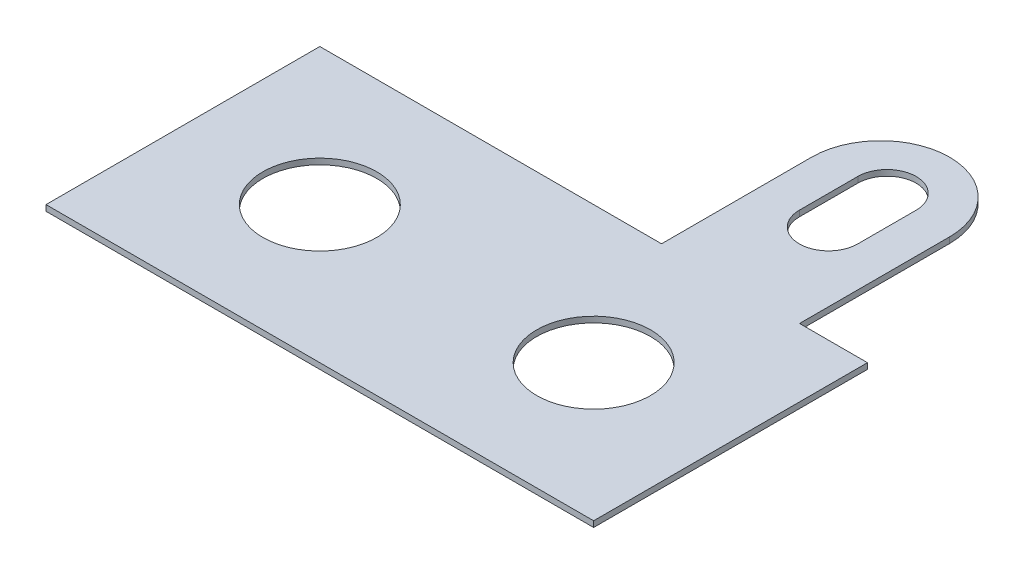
ISO-10303-21;
HEADER;
FILE_DESCRIPTION(('STEP AP214'),'2;1');
FILE_NAME('part.step','',(''),(''),'','','');
FILE_SCHEMA(('AUTOMOTIVE_DESIGN { 1 0 10303 214 1 1 1 1 }'));
ENDSEC;
DATA;
#1=APPLICATION_CONTEXT('core data for automotive mechanical design processes');
#2=APPLICATION_PROTOCOL_DEFINITION('international standard','automotive_design',2000,#1);
#3=PRODUCT_CONTEXT('',#1,'mechanical');
#4=PRODUCT('Part','Part','',(#3));
#5=PRODUCT_RELATED_PRODUCT_CATEGORY('part','',(#4));
#6=PRODUCT_DEFINITION_FORMATION('','',#4);
#7=PRODUCT_DEFINITION_CONTEXT('part definition',#1,'design');
#8=PRODUCT_DEFINITION('design','',#6,#7);
#9=PRODUCT_DEFINITION_SHAPE('','',#8);
#10=(LENGTH_UNIT() NAMED_UNIT(*) SI_UNIT(.MILLI.,.METRE.));
#11=(NAMED_UNIT(*) PLANE_ANGLE_UNIT() SI_UNIT($,.RADIAN.));
#12=(NAMED_UNIT(*) SI_UNIT($,.STERADIAN.) SOLID_ANGLE_UNIT());
#13=UNCERTAINTY_MEASURE_WITH_UNIT(LENGTH_MEASURE(1.E-05),#10,'distance_accuracy_value','');
#14=(GEOMETRIC_REPRESENTATION_CONTEXT(3) GLOBAL_UNCERTAINTY_ASSIGNED_CONTEXT((#13)) GLOBAL_UNIT_ASSIGNED_CONTEXT((#10,
#11,#12)) REPRESENTATION_CONTEXT('',''));
#15=CARTESIAN_POINT('',(0.,0.,0.));
#16=DIRECTION('',(0.,0.,1.));
#17=DIRECTION('',(1.,0.,0.));
#18=AXIS2_PLACEMENT_3D('',#15,#16,#17);
#19=CARTESIAN_POINT('',(-9.525,0.2032,-4.7625));
#20=DIRECTION('',(0.,0.,1.));
#21=DIRECTION('',(1.,0.,0.));
#22=AXIS2_PLACEMENT_3D('',#19,#20,#21);
#23=PLANE('',#22);
#24=DIRECTION('',(0.,-1.,0.));
#25=VECTOR('',#24,1.);
#26=CARTESIAN_POINT('',(7.1628,0.2032,-4.7625));
#27=LINE('',#26,#25);
#28=CARTESIAN_POINT('',(7.1628,0.2032,-4.7625));
#29=VERTEX_POINT('',#28);
#30=CARTESIAN_POINT('',(7.1628,0.,-4.7625));
#31=VERTEX_POINT('',#30);
#32=EDGE_CURVE('E195',#29,#31,#27,.T.);
#33=ORIENTED_EDGE('',*,*,#32,.F.);
#34=DIRECTION('',(-1.,0.,0.));
#35=VECTOR('',#34,1.);
#36=CARTESIAN_POINT('',(-9.525,0.2032,-4.7625));
#37=LINE('',#36,#35);
#38=CARTESIAN_POINT('',(9.525,0.2032,-4.7625));
#39=VERTEX_POINT('',#38);
#40=EDGE_CURVE('E91',#39,#29,#37,.T.);
#41=ORIENTED_EDGE('',*,*,#40,.F.);
#42=DIRECTION('',(0.,-1.,0.));
#43=VECTOR('',#42,1.);
#44=CARTESIAN_POINT('',(9.525,0.2032,-4.7625));
#45=LINE('',#44,#43);
#46=CARTESIAN_POINT('',(9.525,0.,-4.7625));
#47=VERTEX_POINT('',#46);
#48=EDGE_CURVE('E11',#39,#47,#45,.T.);
#49=ORIENTED_EDGE('',*,*,#48,.T.);
#50=DIRECTION('',(-1.,0.,0.));
#51=VECTOR('',#50,1.);
#52=CARTESIAN_POINT('',(-9.525,0.,-4.7625));
#53=LINE('',#52,#51);
#54=EDGE_CURVE('E245',#47,#31,#53,.T.);
#55=ORIENTED_EDGE('',*,*,#54,.T.);
#56=EDGE_LOOP('',(#33,#41,#49,#55));
#57=FACE_BOUND('',#56,.T.);
#58=ADVANCED_FACE('F37',(#57),#23,.F.);
#59=CARTESIAN_POINT('',(0.,0.2032,0.));
#60=DIRECTION('',(0.,-1.,0.));
#61=DIRECTION('',(0.,0.,-1.));
#62=AXIS2_PLACEMENT_3D('',#59,#60,#61);
#63=PLANE('',#62);
#64=CARTESIAN_POINT('',(-4.7625,0.2032,0.));
#65=DIRECTION('',(0.,1.,0.));
#66=DIRECTION('',(0.,0.,1.));
#67=AXIS2_PLACEMENT_3D('',#64,#65,#66);
#68=CIRCLE('',#67,1.9812);
#69=CARTESIAN_POINT('',(-4.7625,0.2032,1.9812));
#70=VERTEX_POINT('',#69);
#71=EDGE_CURVE('E225',#70,#70,#68,.T.);
#72=ORIENTED_EDGE('',*,*,#71,.F.);
#73=EDGE_LOOP('',(#72));
#74=FACE_BOUND('',#73,.T.);
#75=DIRECTION('',(0.,0.,-1.));
#76=VECTOR('',#75,1.);
#77=CARTESIAN_POINT('',(9.525,0.2032,4.7625));
#78=LINE('',#77,#76);
#79=CARTESIAN_POINT('',(9.525,0.2032,4.7625));
#80=VERTEX_POINT('',#79);
#81=EDGE_CURVE('E231',#80,#39,#78,.T.);
#82=ORIENTED_EDGE('',*,*,#81,.T.);
#83=ORIENTED_EDGE('',*,*,#40,.T.);
#84=DIRECTION('',(0.,0.,-1.));
#85=VECTOR('',#84,1.);
#86=CARTESIAN_POINT('',(7.1628,0.2032,0.));
#87=LINE('',#86,#85);
#88=CARTESIAN_POINT('',(7.1628,0.2032,-9.9822));
#89=VERTEX_POINT('',#88);
#90=EDGE_CURVE('E159',#29,#89,#87,.T.);
#91=ORIENTED_EDGE('',*,*,#90,.T.);
#92=CARTESIAN_POINT('',(4.7625,0.2032,-9.9822));
#93=DIRECTION('',(0.,-1.,0.));
#94=DIRECTION('',(0.,0.,-1.));
#95=AXIS2_PLACEMENT_3D('',#92,#93,#94);
#96=CIRCLE('',#95,2.4003);
#97=CARTESIAN_POINT('',(2.3622,0.2032,-9.9822));
#98=VERTEX_POINT('',#97);
#99=EDGE_CURVE('E173',#98,#89,#96,.T.);
#100=ORIENTED_EDGE('',*,*,#99,.F.);
#101=DIRECTION('',(0.,0.,-1.));
#102=VECTOR('',#101,1.);
#103=CARTESIAN_POINT('',(2.3622,0.2032,0.));
#104=LINE('',#103,#102);
#105=CARTESIAN_POINT('',(2.3622,0.2032,-4.7625));
#106=VERTEX_POINT('',#105);
#107=EDGE_CURVE('E172',#106,#98,#104,.T.);
#108=ORIENTED_EDGE('',*,*,#107,.F.);
#109=CARTESIAN_POINT('',(-9.525,0.2032,-4.7625));
#110=VERTEX_POINT('',#109);
#111=EDGE_CURVE('E233',#106,#110,#37,.T.);
#112=ORIENTED_EDGE('',*,*,#111,.T.);
#113=DIRECTION('',(0.,0.,1.));
#114=VECTOR('',#113,1.);
#115=CARTESIAN_POINT('',(-9.525,0.2032,4.7625));
#116=LINE('',#115,#114);
#117=CARTESIAN_POINT('',(-9.525,0.2032,4.7625));
#118=VERTEX_POINT('',#117);
#119=EDGE_CURVE('E236',#110,#118,#116,.T.);
#120=ORIENTED_EDGE('',*,*,#119,.T.);
#121=DIRECTION('',(1.,0.,0.));
#122=VECTOR('',#121,1.);
#123=CARTESIAN_POINT('',(-9.525,0.2032,4.7625));
#124=LINE('',#123,#122);
#125=EDGE_CURVE('E63',#118,#80,#124,.T.);
#126=ORIENTED_EDGE('',*,*,#125,.T.);
#127=EDGE_LOOP('',(#82,#83,#91,#100,#108,#112,#120,#126));
#128=FACE_BOUND('',#127,.T.);
#129=CARTESIAN_POINT('',(4.7625,0.2032,0.));
#130=DIRECTION('',(0.,1.,0.));
#131=DIRECTION('',(0.,0.,-1.));
#132=AXIS2_PLACEMENT_3D('',#129,#130,#131);
#133=CIRCLE('',#132,1.9812);
#134=CARTESIAN_POINT('',(4.7625,0.2032,-1.9812));
#135=VERTEX_POINT('',#134);
#136=EDGE_CURVE('E219',#135,#135,#133,.T.);
#137=ORIENTED_EDGE('',*,*,#136,.F.);
#138=EDGE_LOOP('',(#137));
#139=FACE_BOUND('',#138,.T.);
#140=CARTESIAN_POINT('',(4.7625,0.2032,-8.17171291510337));
#141=DIRECTION('',(0.,-1.,0.));
#142=DIRECTION('',(0.,0.,-1.));
#143=AXIS2_PLACEMENT_3D('',#140,#141,#142);
#144=CIRCLE('',#143,1.016);
#145=CARTESIAN_POINT('',(5.7785,0.2032,-8.17171291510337));
#146=VERTEX_POINT('',#145);
#147=CARTESIAN_POINT('',(3.7465,0.2032,-8.17171291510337));
#148=VERTEX_POINT('',#147);
#149=EDGE_CURVE('E142',#146,#148,#144,.T.);
#150=ORIENTED_EDGE('',*,*,#149,.T.);
#151=DIRECTION('',(0.,0.,1.));
#152=VECTOR('',#151,1.);
#153=CARTESIAN_POINT('',(3.7465,0.2032,0.));
#154=LINE('',#153,#152);
#155=CARTESIAN_POINT('',(3.7465,0.2032,-10.2037129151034));
#156=VERTEX_POINT('',#155);
#157=EDGE_CURVE('E170',#156,#148,#154,.T.);
#158=ORIENTED_EDGE('',*,*,#157,.F.);
#159=CARTESIAN_POINT('',(4.7625,0.2032,-10.2037129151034));
#160=DIRECTION('',(0.,-1.,0.));
#161=DIRECTION('',(0.,0.,-1.));
#162=AXIS2_PLACEMENT_3D('',#159,#160,#161);
#163=CIRCLE('',#162,1.016);
#164=CARTESIAN_POINT('',(5.7785,0.2032,-10.2037129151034));
#165=VERTEX_POINT('',#164);
#166=EDGE_CURVE('E145',#156,#165,#163,.T.);
#167=ORIENTED_EDGE('',*,*,#166,.T.);
#168=DIRECTION('',(0.,0.,1.));
#169=VECTOR('',#168,1.);
#170=CARTESIAN_POINT('',(5.7785,0.2032,0.));
#171=LINE('',#170,#169);
#172=EDGE_CURVE('E137',#165,#146,#171,.T.);
#173=ORIENTED_EDGE('',*,*,#172,.T.);
#174=EDGE_LOOP('',(#150,#158,#167,#173));
#175=FACE_BOUND('',#174,.T.);
#176=ADVANCED_FACE('F139',(#74,#128,#139,#175),#63,.F.);
#177=CARTESIAN_POINT('',(0.,0.,0.));
#178=DIRECTION('',(0.,-1.,0.));
#179=DIRECTION('',(0.,0.,-1.));
#180=AXIS2_PLACEMENT_3D('',#177,#178,#179);
#181=PLANE('',#180);
#182=CARTESIAN_POINT('',(-4.7625,0.,0.));
#183=DIRECTION('',(0.,1.,0.));
#184=DIRECTION('',(0.,0.,1.));
#185=AXIS2_PLACEMENT_3D('',#182,#183,#184);
#186=CIRCLE('',#185,1.9812);
#187=CARTESIAN_POINT('',(-4.7625,0.,1.9812));
#188=VERTEX_POINT('',#187);
#189=EDGE_CURVE('E222',#188,#188,#186,.T.);
#190=ORIENTED_EDGE('',*,*,#189,.T.);
#191=EDGE_LOOP('',(#190));
#192=FACE_BOUND('',#191,.T.);
#193=DIRECTION('',(0.,0.,-1.));
#194=VECTOR('',#193,1.);
#195=CARTESIAN_POINT('',(9.525,0.,4.7625));
#196=LINE('',#195,#194);
#197=CARTESIAN_POINT('',(9.525,0.,4.7625));
#198=VERTEX_POINT('',#197);
#199=EDGE_CURVE('E228',#198,#47,#196,.T.);
#200=ORIENTED_EDGE('',*,*,#199,.F.);
#201=DIRECTION('',(1.,0.,0.));
#202=VECTOR('',#201,1.);
#203=CARTESIAN_POINT('',(-9.525,0.,4.7625));
#204=LINE('',#203,#202);
#205=CARTESIAN_POINT('',(-9.525,0.,4.7625));
#206=VERTEX_POINT('',#205);
#207=EDGE_CURVE('E84',#206,#198,#204,.T.);
#208=ORIENTED_EDGE('',*,*,#207,.F.);
#209=DIRECTION('',(0.,0.,1.));
#210=VECTOR('',#209,1.);
#211=CARTESIAN_POINT('',(-9.525,0.,4.7625));
#212=LINE('',#211,#210);
#213=CARTESIAN_POINT('',(-9.525,0.,-4.7625));
#214=VERTEX_POINT('',#213);
#215=EDGE_CURVE('E249',#214,#206,#212,.T.);
#216=ORIENTED_EDGE('',*,*,#215,.F.);
#217=CARTESIAN_POINT('',(2.36219999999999,0.,-4.7625));
#218=VERTEX_POINT('',#217);
#219=EDGE_CURVE('E242',#218,#214,#53,.T.);
#220=ORIENTED_EDGE('',*,*,#219,.F.);
#221=DIRECTION('',(0.,0.,-1.));
#222=VECTOR('',#221,1.);
#223=CARTESIAN_POINT('',(2.3622,0.,0.));
#224=LINE('',#223,#222);
#225=CARTESIAN_POINT('',(2.3622,0.,-9.9822));
#226=VERTEX_POINT('',#225);
#227=EDGE_CURVE('E54',#218,#226,#224,.T.);
#228=ORIENTED_EDGE('',*,*,#227,.T.);
#229=CARTESIAN_POINT('',(4.7625,0.,-9.9822));
#230=DIRECTION('',(0.,-1.,0.));
#231=DIRECTION('',(0.,0.,-1.));
#232=AXIS2_PLACEMENT_3D('',#229,#230,#231);
#233=CIRCLE('',#232,2.4003);
#234=CARTESIAN_POINT('',(7.1628,0.,-9.9822));
#235=VERTEX_POINT('',#234);
#236=EDGE_CURVE('E167',#226,#235,#233,.T.);
#237=ORIENTED_EDGE('',*,*,#236,.T.);
#238=DIRECTION('',(0.,0.,-1.));
#239=VECTOR('',#238,1.);
#240=CARTESIAN_POINT('',(7.1628,0.,0.));
#241=LINE('',#240,#239);
#242=EDGE_CURVE('E164',#31,#235,#241,.T.);
#243=ORIENTED_EDGE('',*,*,#242,.F.);
#244=ORIENTED_EDGE('',*,*,#54,.F.);
#245=EDGE_LOOP('',(#200,#208,#216,#220,#228,#237,#243,#244));
#246=FACE_BOUND('',#245,.T.);
#247=CARTESIAN_POINT('',(4.7625,0.,0.));
#248=DIRECTION('',(0.,1.,0.));
#249=DIRECTION('',(0.,0.,-1.));
#250=AXIS2_PLACEMENT_3D('',#247,#248,#249);
#251=CIRCLE('',#250,1.9812);
#252=CARTESIAN_POINT('',(4.7625,0.,-1.9812));
#253=VERTEX_POINT('',#252);
#254=EDGE_CURVE('E194',#253,#253,#251,.T.);
#255=ORIENTED_EDGE('',*,*,#254,.T.);
#256=EDGE_LOOP('',(#255));
#257=FACE_BOUND('',#256,.T.);
#258=CARTESIAN_POINT('',(4.7625,0.,-8.17171291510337));
#259=DIRECTION('',(0.,-1.,0.));
#260=DIRECTION('',(0.,0.,-1.));
#261=AXIS2_PLACEMENT_3D('',#258,#259,#260);
#262=CIRCLE('',#261,1.016);
#263=CARTESIAN_POINT('',(5.7785,0.,-8.17171291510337));
#264=VERTEX_POINT('',#263);
#265=CARTESIAN_POINT('',(3.7465,0.,-8.17171291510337));
#266=VERTEX_POINT('',#265);
#267=EDGE_CURVE('E176',#264,#266,#262,.T.);
#268=ORIENTED_EDGE('',*,*,#267,.F.);
#269=DIRECTION('',(0.,0.,1.));
#270=VECTOR('',#269,1.);
#271=CARTESIAN_POINT('',(5.7785,0.,0.));
#272=LINE('',#271,#270);
#273=CARTESIAN_POINT('',(5.7785,0.,-10.2037129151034));
#274=VERTEX_POINT('',#273);
#275=EDGE_CURVE('E154',#274,#264,#272,.T.);
#276=ORIENTED_EDGE('',*,*,#275,.F.);
#277=CARTESIAN_POINT('',(4.7625,0.,-10.2037129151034));
#278=DIRECTION('',(0.,-1.,0.));
#279=DIRECTION('',(0.,0.,-1.));
#280=AXIS2_PLACEMENT_3D('',#277,#278,#279);
#281=CIRCLE('',#280,1.016);
#282=CARTESIAN_POINT('',(3.7465,0.,-10.2037129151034));
#283=VERTEX_POINT('',#282);
#284=EDGE_CURVE('E179',#283,#274,#281,.T.);
#285=ORIENTED_EDGE('',*,*,#284,.F.);
#286=DIRECTION('',(0.,0.,1.));
#287=VECTOR('',#286,1.);
#288=CARTESIAN_POINT('',(3.7465,0.,0.));
#289=LINE('',#288,#287);
#290=EDGE_CURVE('E181',#283,#266,#289,.T.);
#291=ORIENTED_EDGE('',*,*,#290,.T.);
#292=EDGE_LOOP('',(#268,#276,#285,#291));
#293=FACE_BOUND('',#292,.T.);
#294=ADVANCED_FACE('F269',(#192,#246,#257,#293),#181,.T.);
#295=CARTESIAN_POINT('',(9.525,0.2032,4.7625));
#296=DIRECTION('',(-1.,0.,0.));
#297=DIRECTION('',(0.,0.,1.));
#298=AXIS2_PLACEMENT_3D('',#295,#296,#297);
#299=PLANE('',#298);
#300=ORIENTED_EDGE('',*,*,#199,.T.);
#301=ORIENTED_EDGE('',*,*,#48,.F.);
#302=ORIENTED_EDGE('',*,*,#81,.F.);
#303=DIRECTION('',(0.,-1.,0.));
#304=VECTOR('',#303,1.);
#305=CARTESIAN_POINT('',(9.525,0.2032,4.7625));
#306=LINE('',#305,#304);
#307=EDGE_CURVE('E253',#80,#198,#306,.T.);
#308=ORIENTED_EDGE('',*,*,#307,.T.);
#309=EDGE_LOOP('',(#300,#301,#302,#308));
#310=FACE_BOUND('',#309,.T.);
#311=ADVANCED_FACE('F39',(#310),#299,.F.);
#312=ORIENTED_EDGE('',*,*,#111,.F.);
#313=DIRECTION('',(0.,-1.,0.));
#314=VECTOR('',#313,1.);
#315=CARTESIAN_POINT('',(2.3622,0.2032,-4.7625));
#316=LINE('',#315,#314);
#317=EDGE_CURVE('E191',#106,#218,#316,.T.);
#318=ORIENTED_EDGE('',*,*,#317,.T.);
#319=ORIENTED_EDGE('',*,*,#219,.T.);
#320=DIRECTION('',(0.,-1.,0.));
#321=VECTOR('',#320,1.);
#322=CARTESIAN_POINT('',(-9.525,0.2032,-4.7625));
#323=LINE('',#322,#321);
#324=EDGE_CURVE('E46',#110,#214,#323,.T.);
#325=ORIENTED_EDGE('',*,*,#324,.F.);
#326=EDGE_LOOP('',(#312,#318,#319,#325));
#327=FACE_BOUND('',#326,.T.);
#328=ADVANCED_FACE('F279',(#327),#23,.F.);
#329=CARTESIAN_POINT('',(-9.525,0.2032,4.7625));
#330=DIRECTION('',(1.,0.,0.));
#331=DIRECTION('',(0.,0.,-1.));
#332=AXIS2_PLACEMENT_3D('',#329,#330,#331);
#333=PLANE('',#332);
#334=ORIENTED_EDGE('',*,*,#215,.T.);
#335=DIRECTION('',(0.,-1.,0.));
#336=VECTOR('',#335,1.);
#337=CARTESIAN_POINT('',(-9.525,0.2032,4.7625));
#338=LINE('',#337,#336);
#339=EDGE_CURVE('E255',#118,#206,#338,.T.);
#340=ORIENTED_EDGE('',*,*,#339,.F.);
#341=ORIENTED_EDGE('',*,*,#119,.F.);
#342=ORIENTED_EDGE('',*,*,#324,.T.);
#343=EDGE_LOOP('',(#334,#340,#341,#342));
#344=FACE_BOUND('',#343,.T.);
#345=ADVANCED_FACE('F262',(#344),#333,.F.);
#346=CARTESIAN_POINT('',(-9.525,0.2032,4.7625));
#347=DIRECTION('',(0.,0.,-1.));
#348=DIRECTION('',(-1.,0.,0.));
#349=AXIS2_PLACEMENT_3D('',#346,#347,#348);
#350=PLANE('',#349);
#351=ORIENTED_EDGE('',*,*,#207,.T.);
#352=ORIENTED_EDGE('',*,*,#307,.F.);
#353=ORIENTED_EDGE('',*,*,#125,.F.);
#354=ORIENTED_EDGE('',*,*,#339,.T.);
#355=EDGE_LOOP('',(#351,#352,#353,#354));
#356=FACE_BOUND('',#355,.T.);
#357=ADVANCED_FACE('F275',(#356),#350,.F.);
#358=CARTESIAN_POINT('',(-4.7625,0.2032,0.));
#359=DIRECTION('',(0.,-1.,0.));
#360=DIRECTION('',(0.,0.,-1.));
#361=AXIS2_PLACEMENT_3D('',#358,#359,#360);
#362=CYLINDRICAL_SURFACE('',#361,1.9812);
#363=ORIENTED_EDGE('',*,*,#71,.T.);
#364=EDGE_LOOP('',(#363));
#365=FACE_BOUND('',#364,.T.);
#366=ORIENTED_EDGE('',*,*,#189,.F.);
#367=EDGE_LOOP('',(#366));
#368=FACE_BOUND('',#367,.T.);
#369=ADVANCED_FACE('F305',(#365,#368),#362,.F.);
#370=CARTESIAN_POINT('',(4.7625,0.2032,0.));
#371=DIRECTION('',(0.,-1.,0.));
#372=DIRECTION('',(0.,0.,-1.));
#373=AXIS2_PLACEMENT_3D('',#370,#371,#372);
#374=CYLINDRICAL_SURFACE('',#373,1.9812);
#375=ORIENTED_EDGE('',*,*,#136,.T.);
#376=EDGE_LOOP('',(#375));
#377=FACE_BOUND('',#376,.T.);
#378=ORIENTED_EDGE('',*,*,#254,.F.);
#379=EDGE_LOOP('',(#378));
#380=FACE_BOUND('',#379,.T.);
#381=ADVANCED_FACE('F309',(#377,#380),#374,.F.);
#382=CARTESIAN_POINT('',(2.3622,0.2032,0.));
#383=DIRECTION('',(-1.,0.,0.));
#384=DIRECTION('',(0.,0.,1.));
#385=AXIS2_PLACEMENT_3D('',#382,#383,#384);
#386=PLANE('',#385);
#387=ORIENTED_EDGE('',*,*,#227,.F.);
#388=ORIENTED_EDGE('',*,*,#317,.F.);
#389=ORIENTED_EDGE('',*,*,#107,.T.);
#390=DIRECTION('',(0.,-1.,0.));
#391=VECTOR('',#390,1.);
#392=CARTESIAN_POINT('',(2.3622,0.2032,-9.9822));
#393=LINE('',#392,#391);
#394=EDGE_CURVE('E209',#98,#226,#393,.T.);
#395=ORIENTED_EDGE('',*,*,#394,.T.);
#396=EDGE_LOOP('',(#387,#388,#389,#395));
#397=FACE_BOUND('',#396,.T.);
#398=ADVANCED_FACE('F280',(#397),#386,.T.);
#399=CARTESIAN_POINT('',(7.1628,0.2032,0.));
#400=DIRECTION('',(-1.,0.,0.));
#401=DIRECTION('',(0.,0.,1.));
#402=AXIS2_PLACEMENT_3D('',#399,#400,#401);
#403=PLANE('',#402);
#404=ORIENTED_EDGE('',*,*,#242,.T.);
#405=DIRECTION('',(0.,-1.,0.));
#406=VECTOR('',#405,1.);
#407=CARTESIAN_POINT('',(7.1628,0.2032,-9.9822));
#408=LINE('',#407,#406);
#409=EDGE_CURVE('E206',#89,#235,#408,.T.);
#410=ORIENTED_EDGE('',*,*,#409,.F.);
#411=ORIENTED_EDGE('',*,*,#90,.F.);
#412=ORIENTED_EDGE('',*,*,#32,.T.);
#413=EDGE_LOOP('',(#404,#410,#411,#412));
#414=FACE_BOUND('',#413,.T.);
#415=ADVANCED_FACE('F282',(#414),#403,.F.);
#416=CARTESIAN_POINT('',(4.7625,0.2032,-8.17171291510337));
#417=DIRECTION('',(0.,-1.,0.));
#418=DIRECTION('',(0.,0.,-1.));
#419=AXIS2_PLACEMENT_3D('',#416,#417,#418);
#420=CYLINDRICAL_SURFACE('',#419,1.016);
#421=ORIENTED_EDGE('',*,*,#267,.T.);
#422=DIRECTION('',(0.,-1.,0.));
#423=VECTOR('',#422,1.);
#424=CARTESIAN_POINT('',(3.7465,0.2032,-8.17171291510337));
#425=LINE('',#424,#423);
#426=EDGE_CURVE('E162',#148,#266,#425,.T.);
#427=ORIENTED_EDGE('',*,*,#426,.F.);
#428=ORIENTED_EDGE('',*,*,#149,.F.);
#429=DIRECTION('',(0.,-1.,0.));
#430=VECTOR('',#429,1.);
#431=CARTESIAN_POINT('',(5.7785,0.2032,-8.17171291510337));
#432=LINE('',#431,#430);
#433=EDGE_CURVE('E151',#146,#264,#432,.T.);
#434=ORIENTED_EDGE('',*,*,#433,.T.);
#435=EDGE_LOOP('',(#421,#427,#428,#434));
#436=FACE_BOUND('',#435,.T.);
#437=ADVANCED_FACE('F161',(#436),#420,.F.);
#438=CARTESIAN_POINT('',(3.7465,0.2032,0.));
#439=DIRECTION('',(1.,0.,0.));
#440=DIRECTION('',(0.,0.,-1.));
#441=AXIS2_PLACEMENT_3D('',#438,#439,#440);
#442=PLANE('',#441);
#443=ORIENTED_EDGE('',*,*,#290,.F.);
#444=DIRECTION('',(0.,-1.,0.));
#445=VECTOR('',#444,1.);
#446=CARTESIAN_POINT('',(3.7465,0.2032,-10.2037129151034));
#447=LINE('',#446,#445);
#448=EDGE_CURVE('E216',#156,#283,#447,.T.);
#449=ORIENTED_EDGE('',*,*,#448,.F.);
#450=ORIENTED_EDGE('',*,*,#157,.T.);
#451=ORIENTED_EDGE('',*,*,#426,.T.);
#452=EDGE_LOOP('',(#443,#449,#450,#451));
#453=FACE_BOUND('',#452,.T.);
#454=ADVANCED_FACE('F320',(#453),#442,.T.);
#455=CARTESIAN_POINT('',(4.7625,0.2032,-10.2037129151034));
#456=DIRECTION('',(0.,-1.,0.));
#457=DIRECTION('',(0.,0.,-1.));
#458=AXIS2_PLACEMENT_3D('',#455,#456,#457);
#459=CYLINDRICAL_SURFACE('',#458,1.016);
#460=ORIENTED_EDGE('',*,*,#284,.T.);
#461=DIRECTION('',(0.,-1.,0.));
#462=VECTOR('',#461,1.);
#463=CARTESIAN_POINT('',(5.7785,0.2032,-10.2037129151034));
#464=LINE('',#463,#462);
#465=EDGE_CURVE('E158',#165,#274,#464,.T.);
#466=ORIENTED_EDGE('',*,*,#465,.F.);
#467=ORIENTED_EDGE('',*,*,#166,.F.);
#468=ORIENTED_EDGE('',*,*,#448,.T.);
#469=EDGE_LOOP('',(#460,#466,#467,#468));
#470=FACE_BOUND('',#469,.T.);
#471=ADVANCED_FACE('F323',(#470),#459,.F.);
#472=CARTESIAN_POINT('',(5.7785,0.2032,0.));
#473=DIRECTION('',(1.,0.,0.));
#474=DIRECTION('',(0.,0.,-1.));
#475=AXIS2_PLACEMENT_3D('',#472,#473,#474);
#476=PLANE('',#475);
#477=ORIENTED_EDGE('',*,*,#275,.T.);
#478=ORIENTED_EDGE('',*,*,#433,.F.);
#479=ORIENTED_EDGE('',*,*,#172,.F.);
#480=ORIENTED_EDGE('',*,*,#465,.T.);
#481=EDGE_LOOP('',(#477,#478,#479,#480));
#482=FACE_BOUND('',#481,.T.);
#483=ADVANCED_FACE('F152',(#482),#476,.F.);
#484=CARTESIAN_POINT('',(4.7625,0.2032,-9.9822));
#485=DIRECTION('',(0.,-1.,0.));
#486=DIRECTION('',(0.,0.,-1.));
#487=AXIS2_PLACEMENT_3D('',#484,#485,#486);
#488=CYLINDRICAL_SURFACE('',#487,2.4003);
#489=ORIENTED_EDGE('',*,*,#236,.F.);
#490=ORIENTED_EDGE('',*,*,#394,.F.);
#491=ORIENTED_EDGE('',*,*,#99,.T.);
#492=ORIENTED_EDGE('',*,*,#409,.T.);
#493=EDGE_LOOP('',(#489,#490,#491,#492));
#494=FACE_BOUND('',#493,.T.);
#495=ADVANCED_FACE('F281',(#494),#488,.T.);
#496=CLOSED_SHELL('',(#58,#176,#294,#311,#328,#345,#357,#369,#381,#398,#415,#437,#454,#471,#483,#495));
#497=MANIFOLD_SOLID_BREP('B2',#496);
#498=ADVANCED_BREP_SHAPE_REPRESENTATION('',(#18,#497),#14);
#499=SHAPE_DEFINITION_REPRESENTATION(#9,#498);
ENDSEC;
END-ISO-10303-21;
